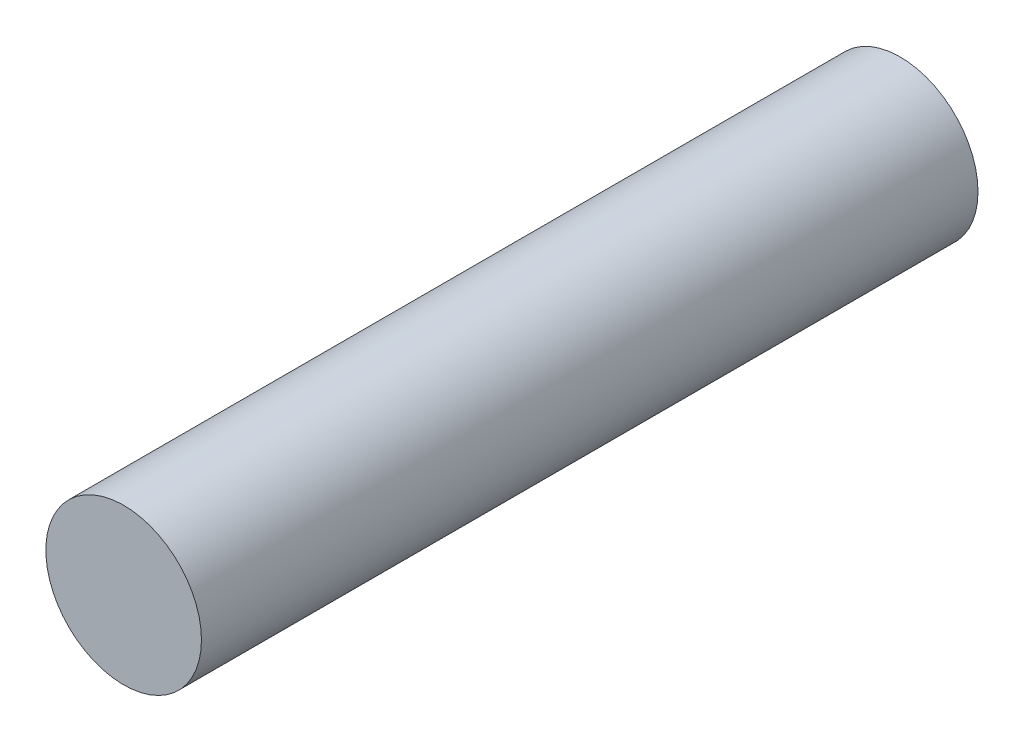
from build123d import *

# Parameters (mm, degrees)
SKETCH1_R      = 15
EXTRUDE1_DEPTH = 149.717743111


with BuildPart() as part:
    # Sketch1 → Extrude1 (new body)
    with BuildSketch(Plane.XY):
        Circle(SKETCH1_R)
    extrude(amount=-EXTRUDE1_DEPTH)


solid = part.part
